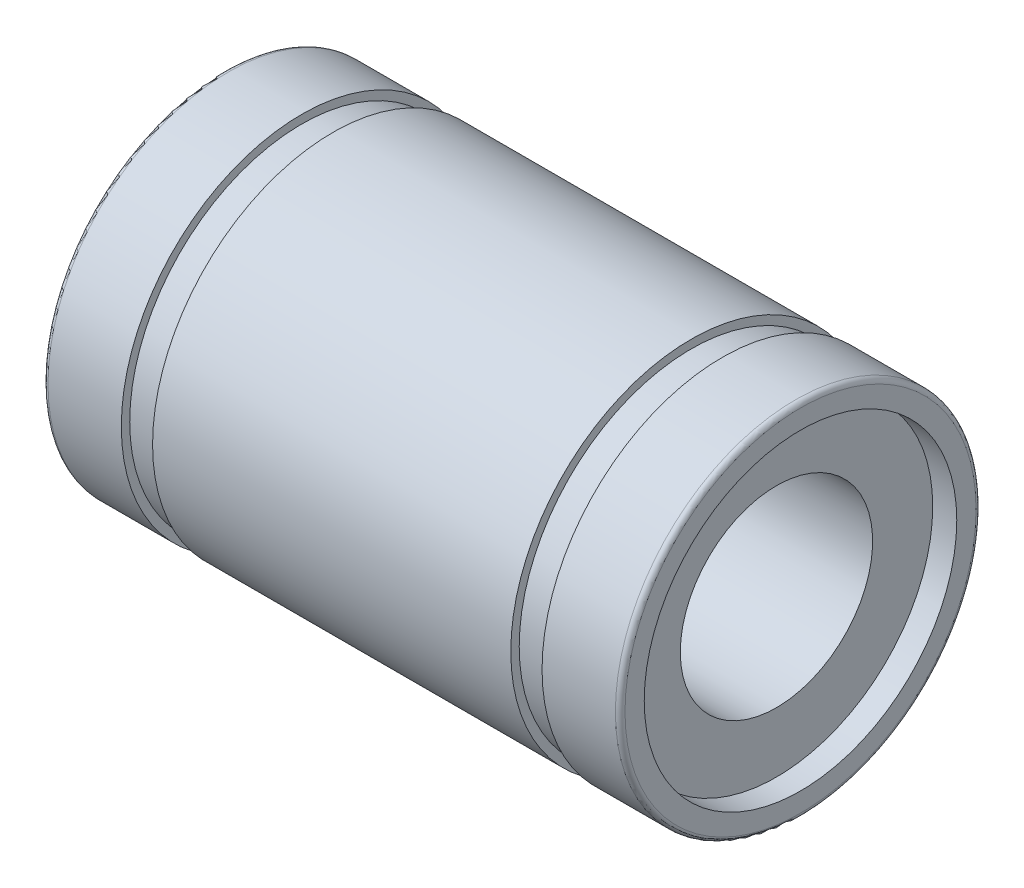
ISO-10303-21;
HEADER;
FILE_DESCRIPTION(('STEP AP214'),'2;1');
FILE_NAME('part.step','',(''),(''),'','','');
FILE_SCHEMA(('AUTOMOTIVE_DESIGN { 1 0 10303 214 1 1 1 1 }'));
ENDSEC;
DATA;
#1=APPLICATION_CONTEXT('core data for automotive mechanical design processes');
#2=APPLICATION_PROTOCOL_DEFINITION('international standard','automotive_design',2000,#1);
#3=PRODUCT_CONTEXT('',#1,'mechanical');
#4=PRODUCT('Part','Part','',(#3));
#5=PRODUCT_RELATED_PRODUCT_CATEGORY('part','',(#4));
#6=PRODUCT_DEFINITION_FORMATION('','',#4);
#7=PRODUCT_DEFINITION_CONTEXT('part definition',#1,'design');
#8=PRODUCT_DEFINITION('design','',#6,#7);
#9=PRODUCT_DEFINITION_SHAPE('','',#8);
#10=(LENGTH_UNIT() NAMED_UNIT(*) SI_UNIT(.MILLI.,.METRE.));
#11=(NAMED_UNIT(*) PLANE_ANGLE_UNIT() SI_UNIT($,.RADIAN.));
#12=(NAMED_UNIT(*) SI_UNIT($,.STERADIAN.) SOLID_ANGLE_UNIT());
#13=UNCERTAINTY_MEASURE_WITH_UNIT(LENGTH_MEASURE(1.E-05),#10,'distance_accuracy_value','');
#14=(GEOMETRIC_REPRESENTATION_CONTEXT(3) GLOBAL_UNCERTAINTY_ASSIGNED_CONTEXT((#13)) GLOBAL_UNIT_ASSIGNED_CONTEXT((#10,
#11,#12)) REPRESENTATION_CONTEXT('',''));
#15=CARTESIAN_POINT('',(0.,0.,0.));
#16=DIRECTION('',(0.,0.,1.));
#17=DIRECTION('',(1.,0.,0.));
#18=AXIS2_PLACEMENT_3D('',#15,#16,#17);
#19=CARTESIAN_POINT('',(6.,0.,0.));
#20=DIRECTION('',(-1.,0.,0.));
#21=DIRECTION('',(0.,0.,1.));
#22=AXIS2_PLACEMENT_3D('',#19,#20,#21);
#23=CYLINDRICAL_SURFACE('',#22,4.);
#24=CARTESIAN_POINT('',(11.,0.,0.));
#25=DIRECTION('',(-1.,0.,0.));
#26=DIRECTION('',(0.,0.,1.));
#27=AXIS2_PLACEMENT_3D('',#24,#25,#26);
#28=CIRCLE('',#27,4.);
#29=CARTESIAN_POINT('',(11.,0.,4.));
#30=VERTEX_POINT('',#29);
#31=EDGE_CURVE('E137',#30,#30,#28,.T.);
#32=ORIENTED_EDGE('',*,*,#31,.F.);
#33=EDGE_LOOP('',(#32));
#34=FACE_BOUND('',#33,.T.);
#35=CARTESIAN_POINT('',(-11.,0.,0.));
#36=DIRECTION('',(-1.,0.,0.));
#37=DIRECTION('',(0.,0.,1.));
#38=AXIS2_PLACEMENT_3D('',#35,#36,#37);
#39=CIRCLE('',#38,4.);
#40=CARTESIAN_POINT('',(-11.,0.,4.));
#41=VERTEX_POINT('',#40);
#42=EDGE_CURVE('E139',#41,#41,#39,.T.);
#43=ORIENTED_EDGE('',*,*,#42,.T.);
#44=EDGE_LOOP('',(#43));
#45=FACE_BOUND('',#44,.T.);
#46=ADVANCED_FACE('F16',(#34,#45),#23,.F.);
#47=CARTESIAN_POINT('',(-11.,0.,0.));
#48=DIRECTION('',(1.,0.,0.));
#49=DIRECTION('',(0.,0.,-1.));
#50=AXIS2_PLACEMENT_3D('',#47,#48,#49);
#51=PLANE('',#50);
#52=ORIENTED_EDGE('',*,*,#42,.F.);
#53=EDGE_LOOP('',(#52));
#54=FACE_BOUND('',#53,.T.);
#55=CARTESIAN_POINT('',(-11.,0.,0.));
#56=DIRECTION('',(-1.,0.,0.));
#57=DIRECTION('',(0.,0.,1.));
#58=AXIS2_PLACEMENT_3D('',#55,#56,#57);
#59=CIRCLE('',#58,6.5);
#60=CARTESIAN_POINT('',(-11.,0.,6.5));
#61=VERTEX_POINT('',#60);
#62=EDGE_CURVE('E133',#61,#61,#59,.T.);
#63=ORIENTED_EDGE('',*,*,#62,.T.);
#64=EDGE_LOOP('',(#63));
#65=FACE_BOUND('',#64,.T.);
#66=ADVANCED_FACE('F335',(#54,#65),#51,.F.);
#67=CARTESIAN_POINT('',(11.,0.,0.));
#68=DIRECTION('',(1.,0.,0.));
#69=DIRECTION('',(0.,0.,-1.));
#70=AXIS2_PLACEMENT_3D('',#67,#68,#69);
#71=PLANE('',#70);
#72=ORIENTED_EDGE('',*,*,#31,.T.);
#73=EDGE_LOOP('',(#72));
#74=FACE_BOUND('',#73,.T.);
#75=CARTESIAN_POINT('',(11.,0.,0.));
#76=DIRECTION('',(-1.,0.,0.));
#77=DIRECTION('',(0.,0.,1.));
#78=AXIS2_PLACEMENT_3D('',#75,#76,#77);
#79=CIRCLE('',#78,6.5);
#80=CARTESIAN_POINT('',(11.,0.,6.5));
#81=VERTEX_POINT('',#80);
#82=EDGE_CURVE('E129',#81,#81,#79,.F.);
#83=ORIENTED_EDGE('',*,*,#82,.T.);
#84=EDGE_LOOP('',(#83));
#85=FACE_BOUND('',#84,.T.);
#86=ADVANCED_FACE('F325',(#74,#85),#71,.T.);
#87=CARTESIAN_POINT('',(-12.,0.,0.));
#88=DIRECTION('',(-1.,0.,0.));
#89=DIRECTION('',(0.,0.,1.));
#90=AXIS2_PLACEMENT_3D('',#87,#88,#89);
#91=CYLINDRICAL_SURFACE('',#90,6.5);
#92=ORIENTED_EDGE('',*,*,#62,.F.);
#93=EDGE_LOOP('',(#92));
#94=FACE_BOUND('',#93,.T.);
#95=CARTESIAN_POINT('',(-12.,0.,0.));
#96=DIRECTION('',(-1.,0.,0.));
#97=DIRECTION('',(0.,0.,1.));
#98=AXIS2_PLACEMENT_3D('',#95,#96,#97);
#99=CIRCLE('',#98,6.5);
#100=CARTESIAN_POINT('',(-12.,0.,6.5));
#101=VERTEX_POINT('',#100);
#102=EDGE_CURVE('E132',#101,#101,#99,.T.);
#103=ORIENTED_EDGE('',*,*,#102,.T.);
#104=EDGE_LOOP('',(#103));
#105=FACE_BOUND('',#104,.T.);
#106=ADVANCED_FACE('F315',(#94,#105),#91,.F.);
#107=CARTESIAN_POINT('',(-12.,0.,0.));
#108=DIRECTION('',(-1.,0.,0.));
#109=DIRECTION('',(0.,0.,1.));
#110=AXIS2_PLACEMENT_3D('',#107,#108,#109);
#111=CYLINDRICAL_SURFACE('',#110,6.5);
#112=CARTESIAN_POINT('',(12.,0.,0.));
#113=DIRECTION('',(-1.,0.,0.));
#114=DIRECTION('',(0.,0.,1.));
#115=AXIS2_PLACEMENT_3D('',#112,#113,#114);
#116=CIRCLE('',#115,6.5);
#117=CARTESIAN_POINT('',(12.,0.,6.5));
#118=VERTEX_POINT('',#117);
#119=EDGE_CURVE('E55',#118,#118,#116,.T.);
#120=ORIENTED_EDGE('',*,*,#119,.F.);
#121=EDGE_LOOP('',(#120));
#122=FACE_BOUND('',#121,.T.);
#123=ORIENTED_EDGE('',*,*,#82,.F.);
#124=EDGE_LOOP('',(#123));
#125=FACE_BOUND('',#124,.T.);
#126=ADVANCED_FACE('F305',(#122,#125),#111,.F.);
#127=CARTESIAN_POINT('',(-12.,0.,5.75));
#128=DIRECTION('',(1.,0.,0.));
#129=DIRECTION('',(0.,0.,-1.));
#130=AXIS2_PLACEMENT_3D('',#127,#128,#129);
#131=PLANE('',#130);
#132=ORIENTED_EDGE('',*,*,#102,.F.);
#133=EDGE_LOOP('',(#132));
#134=FACE_BOUND('',#133,.T.);
#135=CARTESIAN_POINT('',(-12.,0.,0.));
#136=DIRECTION('',(1.,0.,0.));
#137=DIRECTION('',(0.,0.,1.));
#138=AXIS2_PLACEMENT_3D('',#135,#136,#137);
#139=CIRCLE('',#138,7.3);
#140=CARTESIAN_POINT('',(-12.,0.,7.3));
#141=VERTEX_POINT('',#140);
#142=CARTESIAN_POINT('',(-12.,0.,-7.3));
#143=VERTEX_POINT('',#142);
#144=EDGE_CURVE('E48',#141,#143,#139,.T.);
#145=ORIENTED_EDGE('',*,*,#144,.F.);
#146=CARTESIAN_POINT('',(-12.,0.,0.));
#147=DIRECTION('',(1.,0.,0.));
#148=DIRECTION('',(0.,0.,-1.));
#149=AXIS2_PLACEMENT_3D('',#146,#147,#148);
#150=CIRCLE('',#149,7.3);
#151=EDGE_CURVE('E53',#143,#141,#150,.T.);
#152=ORIENTED_EDGE('',*,*,#151,.F.);
#153=EDGE_LOOP('',(#145,#152));
#154=FACE_BOUND('',#153,.T.);
#155=ADVANCED_FACE('F52',(#134,#154),#131,.F.);
#156=CARTESIAN_POINT('',(12.,0.,5.75));
#157=DIRECTION('',(1.,0.,0.));
#158=DIRECTION('',(0.,0.,-1.));
#159=AXIS2_PLACEMENT_3D('',#156,#157,#158);
#160=PLANE('',#159);
#161=ORIENTED_EDGE('',*,*,#119,.T.);
#162=EDGE_LOOP('',(#161));
#163=FACE_BOUND('',#162,.T.);
#164=CARTESIAN_POINT('',(12.,0.,0.));
#165=DIRECTION('',(-1.,0.,0.));
#166=DIRECTION('',(0.,0.,1.));
#167=AXIS2_PLACEMENT_3D('',#164,#165,#166);
#168=CIRCLE('',#167,7.3);
#169=CARTESIAN_POINT('',(12.,0.,7.3));
#170=VERTEX_POINT('',#169);
#171=CARTESIAN_POINT('',(12.,0.,-7.3));
#172=VERTEX_POINT('',#171);
#173=EDGE_CURVE('E39',#170,#172,#168,.T.);
#174=ORIENTED_EDGE('',*,*,#173,.F.);
#175=CARTESIAN_POINT('',(12.,0.,0.));
#176=DIRECTION('',(-1.,0.,0.));
#177=DIRECTION('',(0.,0.,-1.));
#178=AXIS2_PLACEMENT_3D('',#175,#176,#177);
#179=CIRCLE('',#178,7.3);
#180=EDGE_CURVE('E93',#172,#170,#179,.T.);
#181=ORIENTED_EDGE('',*,*,#180,.F.);
#182=EDGE_LOOP('',(#174,#181));
#183=FACE_BOUND('',#182,.T.);
#184=ADVANCED_FACE('F79',(#163,#183),#160,.T.);
#185=CARTESIAN_POINT('',(-11.8,0.,0.));
#186=DIRECTION('',(1.,0.,0.));
#187=DIRECTION('',(0.,0.,-1.));
#188=AXIS2_PLACEMENT_3D('',#185,#186,#187);
#189=TOROIDAL_SURFACE('',#188,7.3,0.2);
#190=CARTESIAN_POINT('',(-11.8,0.,0.));
#191=DIRECTION('',(-1.,0.,0.));
#192=DIRECTION('',(0.,0.,1.));
#193=AXIS2_PLACEMENT_3D('',#190,#191,#192);
#194=CIRCLE('',#193,7.5);
#195=CARTESIAN_POINT('',(-11.8,0.,7.5));
#196=VERTEX_POINT('',#195);
#197=EDGE_CURVE('E90',#196,#196,#194,.F.);
#198=ORIENTED_EDGE('',*,*,#197,.F.);
#199=EDGE_LOOP('',(#198));
#200=FACE_BOUND('',#199,.T.);
#201=ORIENTED_EDGE('',*,*,#151,.T.);
#202=ORIENTED_EDGE('',*,*,#144,.T.);
#203=EDGE_LOOP('',(#201,#202));
#204=FACE_BOUND('',#203,.T.);
#205=ADVANCED_FACE('F59',(#200,#204),#189,.T.);
#206=CARTESIAN_POINT('',(11.8,0.,0.));
#207=DIRECTION('',(-1.,0.,0.));
#208=DIRECTION('',(0.,0.,-1.));
#209=AXIS2_PLACEMENT_3D('',#206,#207,#208);
#210=TOROIDAL_SURFACE('',#209,7.3,0.2);
#211=CARTESIAN_POINT('',(11.8,0.,0.));
#212=DIRECTION('',(-1.,0.,0.));
#213=DIRECTION('',(0.,0.,1.));
#214=AXIS2_PLACEMENT_3D('',#211,#212,#213);
#215=CIRCLE('',#214,7.5);
#216=CARTESIAN_POINT('',(11.8,0.,7.5));
#217=VERTEX_POINT('',#216);
#218=EDGE_CURVE('E89',#217,#217,#215,.T.);
#219=ORIENTED_EDGE('',*,*,#218,.F.);
#220=EDGE_LOOP('',(#219));
#221=FACE_BOUND('',#220,.T.);
#222=ORIENTED_EDGE('',*,*,#180,.T.);
#223=ORIENTED_EDGE('',*,*,#173,.T.);
#224=EDGE_LOOP('',(#222,#223));
#225=FACE_BOUND('',#224,.T.);
#226=ADVANCED_FACE('F78',(#221,#225),#210,.T.);
#227=CARTESIAN_POINT('',(3.725,0.,0.));
#228=DIRECTION('',(-1.,0.,0.));
#229=DIRECTION('',(0.,0.,1.));
#230=AXIS2_PLACEMENT_3D('',#227,#228,#229);
#231=CYLINDRICAL_SURFACE('',#230,7.5);
#232=CARTESIAN_POINT('',(-8.75,0.,0.));
#233=DIRECTION('',(-1.,0.,0.));
#234=DIRECTION('',(0.,0.,1.));
#235=AXIS2_PLACEMENT_3D('',#232,#233,#234);
#236=CIRCLE('',#235,7.5);
#237=CARTESIAN_POINT('',(-8.75,0.,7.5));
#238=VERTEX_POINT('',#237);
#239=EDGE_CURVE('E158',#238,#238,#236,.T.);
#240=ORIENTED_EDGE('',*,*,#239,.T.);
#241=EDGE_LOOP('',(#240));
#242=FACE_BOUND('',#241,.T.);
#243=ORIENTED_EDGE('',*,*,#197,.T.);
#244=EDGE_LOOP('',(#243));
#245=FACE_BOUND('',#244,.T.);
#246=ADVANCED_FACE('F265',(#242,#245),#231,.T.);
#247=CARTESIAN_POINT('',(3.725,0.,0.));
#248=DIRECTION('',(-1.,0.,0.));
#249=DIRECTION('',(0.,0.,1.));
#250=AXIS2_PLACEMENT_3D('',#247,#248,#249);
#251=CYLINDRICAL_SURFACE('',#250,7.5);
#252=CARTESIAN_POINT('',(8.75,0.,0.));
#253=DIRECTION('',(-1.,0.,0.));
#254=DIRECTION('',(0.,0.,1.));
#255=AXIS2_PLACEMENT_3D('',#252,#253,#254);
#256=CIRCLE('',#255,7.5);
#257=CARTESIAN_POINT('',(8.75,0.,7.5));
#258=VERTEX_POINT('',#257);
#259=EDGE_CURVE('E161',#258,#258,#256,.T.);
#260=ORIENTED_EDGE('',*,*,#259,.F.);
#261=EDGE_LOOP('',(#260));
#262=FACE_BOUND('',#261,.T.);
#263=ORIENTED_EDGE('',*,*,#218,.T.);
#264=EDGE_LOOP('',(#263));
#265=FACE_BOUND('',#264,.T.);
#266=ADVANCED_FACE('F254',(#262,#265),#251,.T.);
#267=CARTESIAN_POINT('',(-8.75,0.,7.325));
#268=DIRECTION('',(-1.,0.,0.));
#269=DIRECTION('',(0.,0.,1.));
#270=AXIS2_PLACEMENT_3D('',#267,#268,#269);
#271=PLANE('',#270);
#272=CARTESIAN_POINT('',(-8.75,0.,0.));
#273=DIRECTION('',(-1.,0.,0.));
#274=DIRECTION('',(0.,0.,1.));
#275=AXIS2_PLACEMENT_3D('',#272,#273,#274);
#276=CIRCLE('',#275,7.15);
#277=CARTESIAN_POINT('',(-8.75,0.,7.15));
#278=VERTEX_POINT('',#277);
#279=EDGE_CURVE('E165',#278,#278,#276,.F.);
#280=ORIENTED_EDGE('',*,*,#279,.F.);
#281=EDGE_LOOP('',(#280));
#282=FACE_BOUND('',#281,.T.);
#283=ORIENTED_EDGE('',*,*,#239,.F.);
#284=EDGE_LOOP('',(#283));
#285=FACE_BOUND('',#284,.T.);
#286=ADVANCED_FACE('F244',(#282,#285),#271,.F.);
#287=CARTESIAN_POINT('',(8.75,0.,7.325));
#288=DIRECTION('',(-1.,0.,0.));
#289=DIRECTION('',(0.,0.,1.));
#290=AXIS2_PLACEMENT_3D('',#287,#288,#289);
#291=PLANE('',#290);
#292=CARTESIAN_POINT('',(8.75,0.,0.));
#293=DIRECTION('',(-1.,0.,0.));
#294=DIRECTION('',(0.,0.,1.));
#295=AXIS2_PLACEMENT_3D('',#292,#293,#294);
#296=CIRCLE('',#295,7.15);
#297=CARTESIAN_POINT('',(8.75,0.,7.15));
#298=VERTEX_POINT('',#297);
#299=EDGE_CURVE('E168',#298,#298,#296,.T.);
#300=ORIENTED_EDGE('',*,*,#299,.F.);
#301=EDGE_LOOP('',(#300));
#302=FACE_BOUND('',#301,.T.);
#303=ORIENTED_EDGE('',*,*,#259,.T.);
#304=EDGE_LOOP('',(#303));
#305=FACE_BOUND('',#304,.T.);
#306=ADVANCED_FACE('F234',(#302,#305),#291,.T.);
#307=CARTESIAN_POINT('',(8.1,0.,0.));
#308=DIRECTION('',(-1.,0.,0.));
#309=DIRECTION('',(0.,0.,1.));
#310=AXIS2_PLACEMENT_3D('',#307,#308,#309);
#311=CYLINDRICAL_SURFACE('',#310,7.15);
#312=CARTESIAN_POINT('',(-7.44999999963,0.,0.));
#313=DIRECTION('',(-1.,0.,0.));
#314=DIRECTION('',(0.,0.,1.));
#315=AXIS2_PLACEMENT_3D('',#312,#313,#314);
#316=CIRCLE('',#315,7.15);
#317=CARTESIAN_POINT('',(-7.44999999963,0.,7.15));
#318=VERTEX_POINT('',#317);
#319=EDGE_CURVE('E171',#318,#318,#316,.T.);
#320=ORIENTED_EDGE('',*,*,#319,.T.);
#321=EDGE_LOOP('',(#320));
#322=FACE_BOUND('',#321,.T.);
#323=ORIENTED_EDGE('',*,*,#279,.T.);
#324=EDGE_LOOP('',(#323));
#325=FACE_BOUND('',#324,.T.);
#326=ADVANCED_FACE('F198',(#322,#325),#311,.T.);
#327=CARTESIAN_POINT('',(8.1,0.,0.));
#328=DIRECTION('',(-1.,0.,0.));
#329=DIRECTION('',(0.,0.,1.));
#330=AXIS2_PLACEMENT_3D('',#327,#328,#329);
#331=CYLINDRICAL_SURFACE('',#330,7.15);
#332=CARTESIAN_POINT('',(7.44999999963,0.,0.));
#333=DIRECTION('',(-1.,0.,0.));
#334=DIRECTION('',(0.,0.,1.));
#335=AXIS2_PLACEMENT_3D('',#332,#333,#334);
#336=CIRCLE('',#335,7.15);
#337=CARTESIAN_POINT('',(7.44999999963,0.,7.15));
#338=VERTEX_POINT('',#337);
#339=EDGE_CURVE('E175',#338,#338,#336,.T.);
#340=ORIENTED_EDGE('',*,*,#339,.F.);
#341=EDGE_LOOP('',(#340));
#342=FACE_BOUND('',#341,.T.);
#343=ORIENTED_EDGE('',*,*,#299,.T.);
#344=EDGE_LOOP('',(#343));
#345=FACE_BOUND('',#344,.T.);
#346=ADVANCED_FACE('F188',(#342,#345),#331,.T.);
#347=CARTESIAN_POINT('',(-7.45,0.,7.325));
#348=DIRECTION('',(1.,0.,0.));
#349=DIRECTION('',(0.,0.,-1.));
#350=AXIS2_PLACEMENT_3D('',#347,#348,#349);
#351=PLANE('',#350);
#352=ORIENTED_EDGE('',*,*,#319,.F.);
#353=EDGE_LOOP('',(#352));
#354=FACE_BOUND('',#353,.T.);
#355=CARTESIAN_POINT('',(-7.45000000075,0.,0.));
#356=DIRECTION('',(-1.,0.,0.));
#357=DIRECTION('',(0.,0.,1.));
#358=AXIS2_PLACEMENT_3D('',#355,#356,#357);
#359=CIRCLE('',#358,7.5);
#360=CARTESIAN_POINT('',(-7.45000000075,0.,7.5));
#361=VERTEX_POINT('',#360);
#362=EDGE_CURVE('E28',#361,#361,#359,.F.);
#363=ORIENTED_EDGE('',*,*,#362,.F.);
#364=EDGE_LOOP('',(#363));
#365=FACE_BOUND('',#364,.T.);
#366=ADVANCED_FACE('F185',(#354,#365),#351,.F.);
#367=CARTESIAN_POINT('',(7.45,0.,7.325));
#368=DIRECTION('',(1.,0.,0.));
#369=DIRECTION('',(0.,0.,-1.));
#370=AXIS2_PLACEMENT_3D('',#367,#368,#369);
#371=PLANE('',#370);
#372=ORIENTED_EDGE('',*,*,#339,.T.);
#373=EDGE_LOOP('',(#372));
#374=FACE_BOUND('',#373,.T.);
#375=CARTESIAN_POINT('',(7.44999999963,0.,0.));
#376=DIRECTION('',(-1.,0.,0.));
#377=DIRECTION('',(0.,0.,1.));
#378=AXIS2_PLACEMENT_3D('',#375,#376,#377);
#379=CIRCLE('',#378,7.5);
#380=CARTESIAN_POINT('',(7.44999999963,0.,7.5));
#381=VERTEX_POINT('',#380);
#382=EDGE_CURVE('E11',#381,#381,#379,.T.);
#383=ORIENTED_EDGE('',*,*,#382,.F.);
#384=EDGE_LOOP('',(#383));
#385=FACE_BOUND('',#384,.T.);
#386=ADVANCED_FACE('F187',(#374,#385),#371,.T.);
#387=CARTESIAN_POINT('',(3.725,0.,0.));
#388=DIRECTION('',(-1.,0.,0.));
#389=DIRECTION('',(0.,0.,1.));
#390=AXIS2_PLACEMENT_3D('',#387,#388,#389);
#391=CYLINDRICAL_SURFACE('',#390,7.5);
#392=ORIENTED_EDGE('',*,*,#362,.T.);
#393=EDGE_LOOP('',(#392));
#394=FACE_BOUND('',#393,.T.);
#395=ORIENTED_EDGE('',*,*,#382,.T.);
#396=EDGE_LOOP('',(#395));
#397=FACE_BOUND('',#396,.T.);
#398=ADVANCED_FACE('F182',(#394,#397),#391,.T.);
#399=CLOSED_SHELL('',(#46,#66,#86,#106,#126,#155,#184,#205,#226,#246,#266,#286,#306,#326,#346,
#366,#386,#398));
#400=MANIFOLD_SOLID_BREP('B1',#399);
#401=ADVANCED_BREP_SHAPE_REPRESENTATION('',(#18,#400),#14);
#402=SHAPE_DEFINITION_REPRESENTATION(#9,#401);
ENDSEC;
END-ISO-10303-21;
